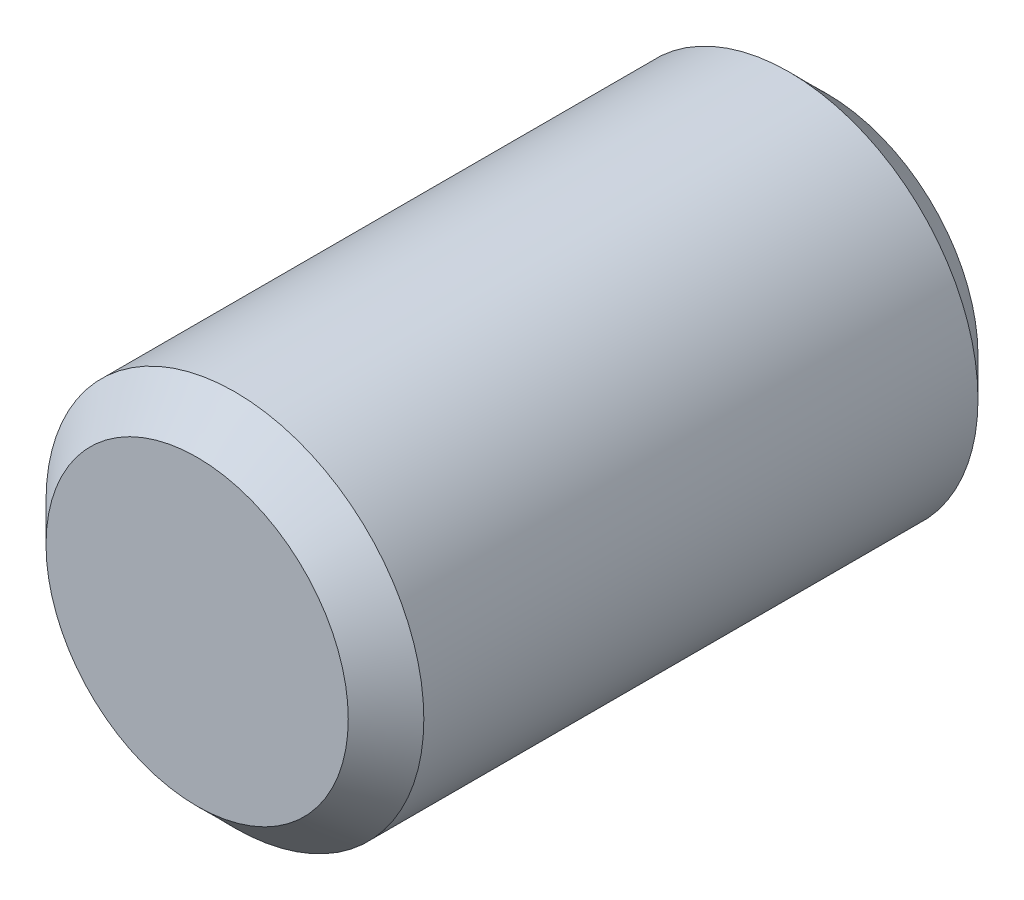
from build123d import *

# Parameters (mm, degrees)
ESQUISSE1_R             = 1.5
BOSS_EXTRU_1_DEPTH      = 5
CHANFREIN1_SIZE         = 0.3
ENL_V_MAT_EXTRU_1_DEPTH = 2


with BuildPart() as part:
    # Esquisse1 → Boss.-Extru.1 (new body)
    with BuildSketch(Plane.XY):
        Circle(ESQUISSE1_R)
    extrude(amount=BOSS_EXTRU_1_DEPTH)

    # Chanfrein1
    chanfrein1_edges = [part.edges().sort_by_distance(p)[0] for p in [
        (-1.5, 0, 0),
        (-1.5, 0, 5),
    ]]
    chamfer(chanfrein1_edges, length=CHANFREIN1_SIZE)

    # Esquisse2 → Enl_v. mat.-Extru.1 (cut)
    with BuildSketch(Plane(origin=(0, 0, 0), x_dir=(-1, 0, 0), z_dir=(0, 0, -1))):
        Polygon((1.154700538, 0), (0.577350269, 1), (-0.577350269, 1), (-1.154700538, 0), (-0.577350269, -1), (0.577350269, -1), align=None)
    extrude(amount=-ENL_V_MAT_EXTRU_1_DEPTH, mode=Mode.SUBTRACT)


solid = part.part
